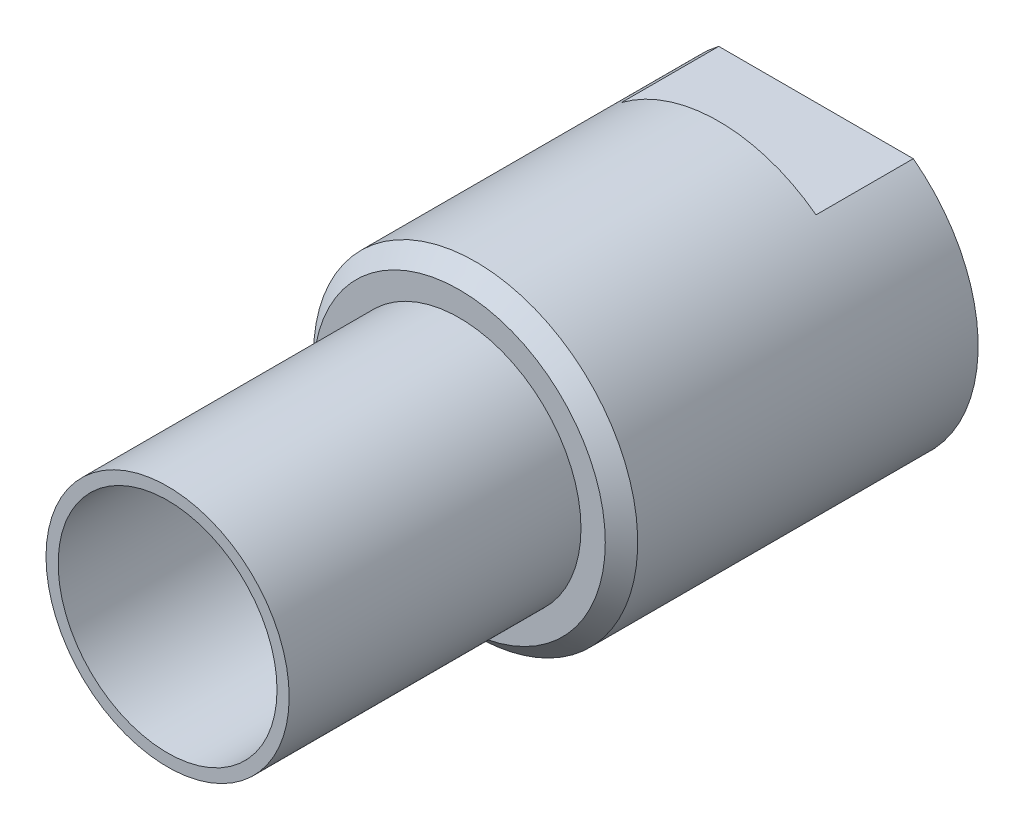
ISO-10303-21;
HEADER;
FILE_DESCRIPTION(('STEP AP214'),'2;1');
FILE_NAME('part.step','',(''),(''),'','','');
FILE_SCHEMA(('AUTOMOTIVE_DESIGN { 1 0 10303 214 1 1 1 1 }'));
ENDSEC;
DATA;
#1=APPLICATION_CONTEXT('core data for automotive mechanical design processes');
#2=APPLICATION_PROTOCOL_DEFINITION('international standard','automotive_design',2000,#1);
#3=PRODUCT_CONTEXT('',#1,'mechanical');
#4=PRODUCT('Part','Part','',(#3));
#5=PRODUCT_RELATED_PRODUCT_CATEGORY('part','',(#4));
#6=PRODUCT_DEFINITION_FORMATION('','',#4);
#7=PRODUCT_DEFINITION_CONTEXT('part definition',#1,'design');
#8=PRODUCT_DEFINITION('design','',#6,#7);
#9=PRODUCT_DEFINITION_SHAPE('','',#8);
#10=(LENGTH_UNIT() NAMED_UNIT(*) SI_UNIT(.MILLI.,.METRE.));
#11=(NAMED_UNIT(*) PLANE_ANGLE_UNIT() SI_UNIT($,.RADIAN.));
#12=(NAMED_UNIT(*) SI_UNIT($,.STERADIAN.) SOLID_ANGLE_UNIT());
#13=UNCERTAINTY_MEASURE_WITH_UNIT(LENGTH_MEASURE(1.E-05),#10,'distance_accuracy_value','');
#14=(GEOMETRIC_REPRESENTATION_CONTEXT(3) GLOBAL_UNCERTAINTY_ASSIGNED_CONTEXT((#13)) GLOBAL_UNIT_ASSIGNED_CONTEXT((#10,
#11,#12)) REPRESENTATION_CONTEXT('',''));
#15=CARTESIAN_POINT('',(0.,0.,0.));
#16=DIRECTION('',(0.,0.,1.));
#17=DIRECTION('',(1.,0.,0.));
#18=AXIS2_PLACEMENT_3D('',#15,#16,#17);
#19=CARTESIAN_POINT('',(0.,0.,19.));
#20=DIRECTION('',(0.,0.,-1.));
#21=DIRECTION('',(-1.,0.,0.));
#22=AXIS2_PLACEMENT_3D('',#19,#20,#21);
#23=CYLINDRICAL_SURFACE('',#22,4.);
#24=CARTESIAN_POINT('',(0.,0.,-22.));
#25=DIRECTION('',(0.,0.,-1.));
#26=DIRECTION('',(-1.,0.,0.));
#27=AXIS2_PLACEMENT_3D('',#24,#25,#26);
#28=CIRCLE('',#27,4.);
#29=CARTESIAN_POINT('',(-4.,0.,-22.));
#30=VERTEX_POINT('',#29);
#31=EDGE_CURVE('E107',#30,#30,#28,.T.);
#32=CARTESIAN_POINT('',(0.,0.,8.));
#33=DIRECTION('',(0.,0.,1.));
#34=DIRECTION('',(1.,0.,0.));
#35=AXIS2_PLACEMENT_3D('',#32,#33,#34);
#36=CIRCLE('',#35,4.);
#37=CARTESIAN_POINT('',(-4.,0.,8.));
#38=VERTEX_POINT('',#37);
#39=EDGE_CURVE('E119',#38,#38,#36,.F.);
#40=CARTESIAN_POINT('',(-4.,0.,-22.));
#41=CARTESIAN_POINT('',(-4.,0.,-21.6875));
#42=CARTESIAN_POINT('',(-4.,0.,-21.375));
#43=CARTESIAN_POINT('',(-4.,0.,-20.75));
#44=CARTESIAN_POINT('',(-4.,0.,-20.4375));
#45=CARTESIAN_POINT('',(-4.,0.,-19.8125));
#46=CARTESIAN_POINT('',(-4.,0.,-19.5));
#47=CARTESIAN_POINT('',(-4.,0.,-18.875));
#48=CARTESIAN_POINT('',(-4.,0.,-18.5625));
#49=CARTESIAN_POINT('',(-4.,0.,-17.9375));
#50=CARTESIAN_POINT('',(-4.,0.,-17.625));
#51=CARTESIAN_POINT('',(-4.,0.,-17.));
#52=CARTESIAN_POINT('',(-4.,0.,-16.6875));
#53=CARTESIAN_POINT('',(-4.,0.,-16.0625));
#54=CARTESIAN_POINT('',(-4.,0.,-15.75));
#55=CARTESIAN_POINT('',(-4.,0.,-15.125));
#56=CARTESIAN_POINT('',(-4.,0.,-14.8125));
#57=CARTESIAN_POINT('',(-4.,0.,-14.1875));
#58=CARTESIAN_POINT('',(-4.,0.,-13.875));
#59=CARTESIAN_POINT('',(-4.,0.,-13.25));
#60=CARTESIAN_POINT('',(-4.,0.,-12.9375));
#61=CARTESIAN_POINT('',(-4.,0.,-12.3125));
#62=CARTESIAN_POINT('',(-4.,0.,-12.));
#63=CARTESIAN_POINT('',(-4.,0.,-11.375));
#64=CARTESIAN_POINT('',(-4.,0.,-11.0625));
#65=CARTESIAN_POINT('',(-4.,0.,-10.4375));
#66=CARTESIAN_POINT('',(-4.,0.,-10.125));
#67=CARTESIAN_POINT('',(-4.,0.,-9.5));
#68=CARTESIAN_POINT('',(-4.,0.,-9.1875));
#69=CARTESIAN_POINT('',(-4.,0.,-8.5625));
#70=CARTESIAN_POINT('',(-4.,0.,-8.25));
#71=CARTESIAN_POINT('',(-4.,0.,-7.625));
#72=CARTESIAN_POINT('',(-4.,0.,-7.3125));
#73=CARTESIAN_POINT('',(-4.,0.,-6.6875));
#74=CARTESIAN_POINT('',(-4.,0.,-6.375));
#75=CARTESIAN_POINT('',(-4.,0.,-5.75));
#76=CARTESIAN_POINT('',(-4.,0.,-5.4375));
#77=CARTESIAN_POINT('',(-4.,0.,-4.8125));
#78=CARTESIAN_POINT('',(-4.,0.,-4.5));
#79=CARTESIAN_POINT('',(-4.,0.,-3.875));
#80=CARTESIAN_POINT('',(-4.,0.,-3.5625));
#81=CARTESIAN_POINT('',(-4.,0.,-2.9375));
#82=CARTESIAN_POINT('',(-4.,0.,-2.625));
#83=CARTESIAN_POINT('',(-4.,0.,-2.));
#84=CARTESIAN_POINT('',(-4.,0.,-1.6875));
#85=CARTESIAN_POINT('',(-4.,0.,-1.0625));
#86=CARTESIAN_POINT('',(-4.,0.,-0.749999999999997));
#87=CARTESIAN_POINT('',(-4.,0.,-0.124999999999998));
#88=CARTESIAN_POINT('',(-4.,0.,0.187500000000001));
#89=CARTESIAN_POINT('',(-4.,0.,0.812500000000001));
#90=CARTESIAN_POINT('',(-4.,0.,1.125));
#91=CARTESIAN_POINT('',(-4.,0.,1.75));
#92=CARTESIAN_POINT('',(-4.,0.,2.0625));
#93=CARTESIAN_POINT('',(-4.,0.,2.6875));
#94=CARTESIAN_POINT('',(-4.,0.,3.));
#95=CARTESIAN_POINT('',(-4.,0.,3.625));
#96=CARTESIAN_POINT('',(-4.,0.,3.9375));
#97=CARTESIAN_POINT('',(-4.,0.,4.5625));
#98=CARTESIAN_POINT('',(-4.,0.,4.875));
#99=CARTESIAN_POINT('',(-4.,0.,5.5));
#100=CARTESIAN_POINT('',(-4.,0.,5.8125));
#101=CARTESIAN_POINT('',(-4.,0.,6.4375));
#102=CARTESIAN_POINT('',(-4.,0.,6.75));
#103=CARTESIAN_POINT('',(-4.,0.,7.375));
#104=CARTESIAN_POINT('',(-4.,0.,7.6875));
#105=CARTESIAN_POINT('',(-4.,0.,8.));
#106=B_SPLINE_CURVE_WITH_KNOTS('',3,(#40,#41,#42,#43,#44,#45,#46,#47,#48,#49,#50,#51,#52,#53,
#54,#55,#56,#57,#58,#59,#60,#61,#62,#63,#64,#65,#66,#67,#68,#69,#70,#71,#72,#73,#74,#75,#76,#77,
#78,#79,#80,#81,#82,#83,#84,#85,#86,#87,#88,#89,#90,#91,#92,#93,#94,#95,#96,#97,#98,#99,#100,
#101,#102,#103,#104,#105),.UNSPECIFIED.,.F.,.F.,(4,2,2,2,2,2,2,2,2,2,2,2,2,2,2,2,2,2,2,2,2,2,2,
2,2,2,2,2,2,2,2,2,4),(0.,0.937500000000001,1.875,2.8125,3.75,4.6875,5.625,6.5625,7.5,8.4375,
9.37499999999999,10.3125,11.25,12.1875,13.125,14.0625,15.,15.9375,16.875,17.8125,18.75,19.6875,
20.625,21.5625,22.5,23.4375,24.375,25.3125,26.25,27.1875,28.125,29.0625,30.),.UNSPECIFIED.);
#107=EDGE_CURVE('BSEAM42',#30,#38,#106,.T.);
#108=ORIENTED_EDGE('',*,*,#31,.T.);
#109=ORIENTED_EDGE('',*,*,#39,.F.);
#110=ORIENTED_EDGE('',*,*,#107,.T.);
#111=ORIENTED_EDGE('',*,*,#107,.F.);
#112=EDGE_LOOP('',(#108,#110,#109,#111));
#113=FACE_BOUND('',#112,.T.);
#114=ADVANCED_FACE('F42',(#113),#23,.F.);
#115=CARTESIAN_POINT('',(0.,0.,18.));
#116=DIRECTION('',(0.,0.,-1.));
#117=DIRECTION('',(-1.,0.,0.));
#118=AXIS2_PLACEMENT_3D('',#115,#116,#117);
#119=CYLINDRICAL_SURFACE('',#118,7.5);
#120=CARTESIAN_POINT('',(0.,0.,18.));
#121=DIRECTION('',(0.,0.,1.));
#122=DIRECTION('',(1.,0.,0.));
#123=AXIS2_PLACEMENT_3D('',#120,#121,#122);
#124=CIRCLE('',#123,7.5);
#125=CARTESIAN_POINT('',(7.5,0.,18.));
#126=VERTEX_POINT('',#125);
#127=EDGE_CURVE('E105',#126,#126,#124,.T.);
#128=ORIENTED_EDGE('',*,*,#127,.F.);
#129=EDGE_LOOP('',(#128));
#130=FACE_BOUND('',#129,.T.);
#131=CARTESIAN_POINT('',(0.,0.,0.));
#132=DIRECTION('',(0.,0.,-1.));
#133=DIRECTION('',(-1.,0.,0.));
#134=AXIS2_PLACEMENT_3D('',#131,#132,#133);
#135=CIRCLE('',#134,7.5);
#136=CARTESIAN_POINT('',(-7.5,0.,0.));
#137=VERTEX_POINT('',#136);
#138=EDGE_CURVE('E101',#137,#137,#135,.T.);
#139=ORIENTED_EDGE('',*,*,#138,.F.);
#140=EDGE_LOOP('',(#139));
#141=FACE_BOUND('',#140,.T.);
#142=ADVANCED_FACE('F148',(#130,#141),#119,.T.);
#143=CARTESIAN_POINT('',(0.,0.,18.));
#144=DIRECTION('',(0.,0.,1.));
#145=DIRECTION('',(1.,0.,0.));
#146=AXIS2_PLACEMENT_3D('',#143,#144,#145);
#147=PLANE('',#146);
#148=CARTESIAN_POINT('',(0.,0.,18.));
#149=DIRECTION('',(0.,0.,1.));
#150=DIRECTION('',(1.,0.,0.));
#151=AXIS2_PLACEMENT_3D('',#148,#149,#150);
#152=CIRCLE('',#151,6.75);
#153=CARTESIAN_POINT('',(6.75,0.,18.));
#154=VERTEX_POINT('',#153);
#155=EDGE_CURVE('E137',#154,#154,#152,.T.);
#156=ORIENTED_EDGE('',*,*,#155,.F.);
#157=EDGE_LOOP('',(#156));
#158=FACE_BOUND('',#157,.T.);
#159=ORIENTED_EDGE('',*,*,#127,.T.);
#160=EDGE_LOOP('',(#159));
#161=FACE_BOUND('',#160,.T.);
#162=ADVANCED_FACE('F144',(#158,#161),#147,.T.);
#163=CARTESIAN_POINT('',(0.,0.,0.));
#164=DIRECTION('',(0.,0.,-1.));
#165=DIRECTION('',(-1.,0.,0.));
#166=AXIS2_PLACEMENT_3D('',#163,#164,#165);
#167=PLANE('',#166);
#168=CARTESIAN_POINT('',(0.,0.,0.));
#169=DIRECTION('',(0.,0.,-1.));
#170=DIRECTION('',(-1.,0.,0.));
#171=AXIS2_PLACEMENT_3D('',#168,#169,#170);
#172=CIRCLE('',#171,8.99999999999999);
#173=CARTESIAN_POINT('',(-8.99999999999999,0.,0.));
#174=VERTEX_POINT('',#173);
#175=EDGE_CURVE('E116',#174,#174,#172,.F.);
#176=ORIENTED_EDGE('',*,*,#175,.T.);
#177=EDGE_LOOP('',(#176));
#178=FACE_BOUND('',#177,.T.);
#179=ORIENTED_EDGE('',*,*,#138,.T.);
#180=EDGE_LOOP('',(#179));
#181=FACE_BOUND('',#180,.T.);
#182=ADVANCED_FACE('F147',(#178,#181),#167,.F.);
#183=CARTESIAN_POINT('',(0.,0.,-22.));
#184=DIRECTION('',(0.,0.,1.));
#185=DIRECTION('',(1.,0.,0.));
#186=AXIS2_PLACEMENT_3D('',#183,#184,#185);
#187=CYLINDRICAL_SURFACE('',#186,10.);
#188=CARTESIAN_POINT('',(0.,0.,-22.));
#189=DIRECTION('',(0.,0.,-1.));
#190=DIRECTION('',(-1.,0.,0.));
#191=AXIS2_PLACEMENT_3D('',#188,#189,#190);
#192=CIRCLE('',#191,10.);
#193=CARTESIAN_POINT('',(-6.,-8.,-22.));
#194=VERTEX_POINT('',#193);
#195=CARTESIAN_POINT('',(-6.,8.,-22.));
#196=VERTEX_POINT('',#195);
#197=EDGE_CURVE('E102',#194,#196,#192,.T.);
#198=ORIENTED_EDGE('',*,*,#197,.F.);
#199=DIRECTION('',(0.,0.,1.));
#200=VECTOR('',#199,1.);
#201=CARTESIAN_POINT('',(-6.,-8.,-22.));
#202=LINE('',#201,#200);
#203=CARTESIAN_POINT('',(-6.,-8.,-16.));
#204=VERTEX_POINT('',#203);
#205=EDGE_CURVE('E57',#194,#204,#202,.T.);
#206=ORIENTED_EDGE('',*,*,#205,.T.);
#207=CARTESIAN_POINT('',(0.,0.,-16.));
#208=DIRECTION('',(0.,0.,-1.));
#209=DIRECTION('',(-1.,0.,0.));
#210=AXIS2_PLACEMENT_3D('',#207,#208,#209);
#211=CIRCLE('',#210,10.);
#212=CARTESIAN_POINT('',(6.,-8.,-16.));
#213=VERTEX_POINT('',#212);
#214=EDGE_CURVE('E13',#213,#204,#211,.T.);
#215=ORIENTED_EDGE('',*,*,#214,.F.);
#216=DIRECTION('',(0.,0.,1.));
#217=VECTOR('',#216,1.);
#218=CARTESIAN_POINT('',(6.,-8.,-22.));
#219=LINE('',#218,#217);
#220=CARTESIAN_POINT('',(6.,-8.,-22.));
#221=VERTEX_POINT('',#220);
#222=EDGE_CURVE('E84',#213,#221,#219,.F.);
#223=ORIENTED_EDGE('',*,*,#222,.T.);
#224=CARTESIAN_POINT('',(6.,8.,-22.));
#225=VERTEX_POINT('',#224);
#226=EDGE_CURVE('E95',#225,#221,#192,.T.);
#227=ORIENTED_EDGE('',*,*,#226,.F.);
#228=DIRECTION('',(0.,0.,1.));
#229=VECTOR('',#228,1.);
#230=CARTESIAN_POINT('',(6.,8.,-22.));
#231=LINE('',#230,#229);
#232=CARTESIAN_POINT('',(6.,8.,-16.));
#233=VERTEX_POINT('',#232);
#234=EDGE_CURVE('E65',#225,#233,#231,.T.);
#235=ORIENTED_EDGE('',*,*,#234,.T.);
#236=CARTESIAN_POINT('',(0.,0.,-16.));
#237=DIRECTION('',(0.,0.,1.));
#238=DIRECTION('',(1.,0.,0.));
#239=AXIS2_PLACEMENT_3D('',#236,#237,#238);
#240=CIRCLE('',#239,10.);
#241=CARTESIAN_POINT('',(-6.,8.,-16.));
#242=VERTEX_POINT('',#241);
#243=EDGE_CURVE('E89',#233,#242,#240,.T.);
#244=ORIENTED_EDGE('',*,*,#243,.T.);
#245=DIRECTION('',(0.,0.,1.));
#246=VECTOR('',#245,1.);
#247=CARTESIAN_POINT('',(-6.,8.,-22.));
#248=LINE('',#247,#246);
#249=EDGE_CURVE('E126',#242,#196,#248,.F.);
#250=ORIENTED_EDGE('',*,*,#249,.T.);
#251=EDGE_LOOP('',(#198,#206,#215,#223,#227,#235,#244,#250));
#252=FACE_BOUND('',#251,.T.);
#253=CARTESIAN_POINT('',(0.,0.,-1.00000000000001));
#254=DIRECTION('',(0.,0.,-1.));
#255=DIRECTION('',(-1.,0.,0.));
#256=AXIS2_PLACEMENT_3D('',#253,#254,#255);
#257=CIRCLE('',#256,10.);
#258=CARTESIAN_POINT('',(-10.,0.,-1.00000000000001));
#259=VERTEX_POINT('',#258);
#260=EDGE_CURVE('E113',#259,#259,#257,.T.);
#261=ORIENTED_EDGE('',*,*,#260,.T.);
#262=EDGE_LOOP('',(#261));
#263=FACE_BOUND('',#262,.T.);
#264=ADVANCED_FACE('F93',(#252,#263),#187,.T.);
#265=CARTESIAN_POINT('',(0.,0.,-22.));
#266=DIRECTION('',(0.,0.,-1.));
#267=DIRECTION('',(-1.,0.,0.));
#268=AXIS2_PLACEMENT_3D('',#265,#266,#267);
#269=PLANE('',#268);
#270=DIRECTION('',(1.,0.,0.));
#271=VECTOR('',#270,1.);
#272=CARTESIAN_POINT('',(0.,-8.,-22.));
#273=LINE('',#272,#271);
#274=EDGE_CURVE('E50',#194,#221,#273,.T.);
#275=ORIENTED_EDGE('',*,*,#274,.F.);
#276=ORIENTED_EDGE('',*,*,#197,.T.);
#277=DIRECTION('',(-1.,0.,0.));
#278=VECTOR('',#277,1.);
#279=CARTESIAN_POINT('',(0.,8.,-22.));
#280=LINE('',#279,#278);
#281=EDGE_CURVE('E100',#225,#196,#280,.T.);
#282=ORIENTED_EDGE('',*,*,#281,.F.);
#283=ORIENTED_EDGE('',*,*,#226,.T.);
#284=EDGE_LOOP('',(#275,#276,#282,#283));
#285=FACE_BOUND('',#284,.T.);
#286=ORIENTED_EDGE('',*,*,#31,.F.);
#287=EDGE_LOOP('',(#286));
#288=FACE_BOUND('',#287,.T.);
#289=ADVANCED_FACE('F98',(#285,#288),#269,.T.);
#290=CARTESIAN_POINT('',(0.,0.,-1.00000000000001));
#291=DIRECTION('',(0.,0.,-1.));
#292=DIRECTION('',(-1.,0.,0.));
#293=AXIS2_PLACEMENT_3D('',#290,#291,#292);
#294=CONICAL_SURFACE('',#293,10.,0.785398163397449);
#295=ORIENTED_EDGE('',*,*,#175,.F.);
#296=EDGE_LOOP('',(#295));
#297=FACE_BOUND('',#296,.T.);
#298=ORIENTED_EDGE('',*,*,#260,.F.);
#299=EDGE_LOOP('',(#298));
#300=FACE_BOUND('',#299,.T.);
#301=ADVANCED_FACE('F44',(#297,#300),#294,.T.);
#302=CARTESIAN_POINT('',(0.,0.,8.));
#303=DIRECTION('',(0.,0.,1.));
#304=DIRECTION('',(1.,0.,0.));
#305=AXIS2_PLACEMENT_3D('',#302,#303,#304);
#306=PLANE('',#305);
#307=CARTESIAN_POINT('',(0.,0.,8.));
#308=DIRECTION('',(0.,0.,1.));
#309=DIRECTION('',(1.,0.,0.));
#310=AXIS2_PLACEMENT_3D('',#307,#308,#309);
#311=CIRCLE('',#310,6.75);
#312=CARTESIAN_POINT('',(6.75,0.,8.));
#313=VERTEX_POINT('',#312);
#314=EDGE_CURVE('E122',#313,#313,#311,.T.);
#315=ORIENTED_EDGE('',*,*,#314,.T.);
#316=EDGE_LOOP('',(#315));
#317=FACE_BOUND('',#316,.T.);
#318=ORIENTED_EDGE('',*,*,#39,.T.);
#319=EDGE_LOOP('',(#318));
#320=FACE_BOUND('',#319,.T.);
#321=ADVANCED_FACE('F177',(#317,#320),#306,.T.);
#322=CARTESIAN_POINT('',(0.,0.,8.));
#323=DIRECTION('',(0.,0.,1.));
#324=DIRECTION('',(1.,0.,0.));
#325=AXIS2_PLACEMENT_3D('',#322,#323,#324);
#326=CYLINDRICAL_SURFACE('',#325,6.75);
#327=ORIENTED_EDGE('',*,*,#314,.F.);
#328=EDGE_LOOP('',(#327));
#329=FACE_BOUND('',#328,.T.);
#330=ORIENTED_EDGE('',*,*,#155,.T.);
#331=EDGE_LOOP('',(#330));
#332=FACE_BOUND('',#331,.T.);
#333=ADVANCED_FACE('F142',(#329,#332),#326,.F.);
#334=CARTESIAN_POINT('',(11.6876323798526,10.229640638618,-16.));
#335=DIRECTION('',(0.,0.,1.));
#336=DIRECTION('',(1.,0.,0.));
#337=AXIS2_PLACEMENT_3D('',#334,#335,#336);
#338=PLANE('',#337);
#339=DIRECTION('',(-1.,0.,0.));
#340=VECTOR('',#339,1.);
#341=CARTESIAN_POINT('',(11.6876323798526,8.,-16.));
#342=LINE('',#341,#340);
#343=EDGE_CURVE('E130',#233,#242,#342,.T.);
#344=ORIENTED_EDGE('',*,*,#343,.T.);
#345=ORIENTED_EDGE('',*,*,#243,.F.);
#346=EDGE_LOOP('',(#344,#345));
#347=FACE_BOUND('',#346,.T.);
#348=ADVANCED_FACE('F129',(#347),#338,.F.);
#349=CARTESIAN_POINT('',(11.6876323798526,8.,-16.));
#350=DIRECTION('',(0.,-1.,0.));
#351=DIRECTION('',(0.,0.,-1.));
#352=AXIS2_PLACEMENT_3D('',#349,#350,#351);
#353=PLANE('',#352);
#354=ORIENTED_EDGE('',*,*,#281,.T.);
#355=ORIENTED_EDGE('',*,*,#249,.F.);
#356=ORIENTED_EDGE('',*,*,#343,.F.);
#357=ORIENTED_EDGE('',*,*,#234,.F.);
#358=EDGE_LOOP('',(#354,#355,#356,#357));
#359=FACE_BOUND('',#358,.T.);
#360=ADVANCED_FACE('F131',(#359),#353,.F.);
#361=CARTESIAN_POINT('',(-10.2851164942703,-8.,-16.));
#362=DIRECTION('',(0.,0.,-1.));
#363=DIRECTION('',(-1.,0.,0.));
#364=AXIS2_PLACEMENT_3D('',#361,#362,#363);
#365=PLANE('',#364);
#366=ORIENTED_EDGE('',*,*,#214,.T.);
#367=DIRECTION('',(1.,0.,0.));
#368=VECTOR('',#367,1.);
#369=CARTESIAN_POINT('',(-10.2851164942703,-8.,-16.));
#370=LINE('',#369,#368);
#371=EDGE_CURVE('E96',#204,#213,#370,.T.);
#372=ORIENTED_EDGE('',*,*,#371,.T.);
#373=EDGE_LOOP('',(#366,#372));
#374=FACE_BOUND('',#373,.T.);
#375=ADVANCED_FACE('F194',(#374),#365,.T.);
#376=CARTESIAN_POINT('',(-10.2851164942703,-8.,-16.));
#377=DIRECTION('',(0.,1.,0.));
#378=DIRECTION('',(-1.,0.,0.));
#379=AXIS2_PLACEMENT_3D('',#376,#377,#378);
#380=PLANE('',#379);
#381=ORIENTED_EDGE('',*,*,#274,.T.);
#382=ORIENTED_EDGE('',*,*,#222,.F.);
#383=ORIENTED_EDGE('',*,*,#371,.F.);
#384=ORIENTED_EDGE('',*,*,#205,.F.);
#385=EDGE_LOOP('',(#381,#382,#383,#384));
#386=FACE_BOUND('',#385,.T.);
#387=ADVANCED_FACE('F83',(#386),#380,.F.);
#388=CLOSED_SHELL('',(#114,#142,#162,#182,#264,#289,#301,#321,#333,#348,#360,#375,#387));
#389=MANIFOLD_SOLID_BREP('B2',#388);
#390=ADVANCED_BREP_SHAPE_REPRESENTATION('',(#18,#389),#14);
#391=SHAPE_DEFINITION_REPRESENTATION(#9,#390);
ENDSEC;
END-ISO-10303-21;
